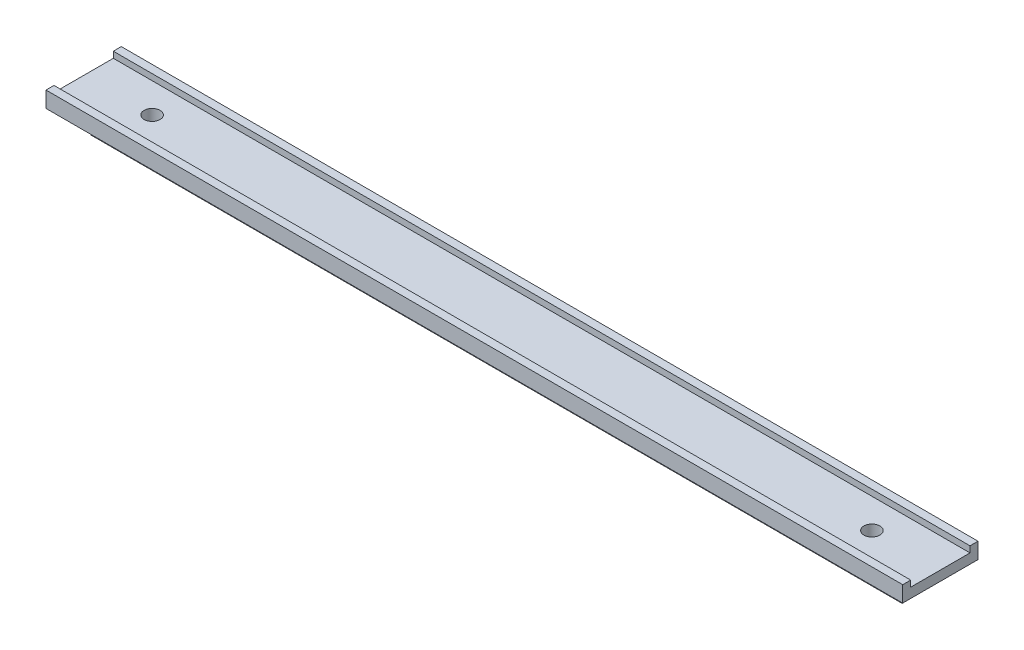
from build123d import *

# Parameters (mm, degrees)
LIUKUKISKOT_HIHNALLE_1_6038_LIUKUKISKO_H_DEPTH = 375.5
CUT_EXTRUDE1_REACH                             = 191.378
F_7_0_7_DIAMETER_HOLE1_D                       = 7
F_7_0_7_DIAMETER_HOLE1_DEPTH                   = 14.3
F_7_0_7_DIAMETER_HOLE1_CSINK_D                 = 7.05
F_7_0_7_DIAMETER_HOLE1_CSINK_ANGLE             = 90
F_7_0_7_DIAMETER_HOLE1_TIP                     = 2.103012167


with BuildPart() as part:
    # Sketch1 → Liukukiskot hihnalle 1.6038 LIUKUKISKO H (new body)
    with BuildSketch(Plane(origin=(-187.75, 0, 0), x_dir=(0, 0, -1), z_dir=(1, 0, 0))):
        Polygon((-16.468721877, 8.565639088), (-16.468721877, 1.565639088), (-3.968721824, 1.565639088), (-3.968721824, -3.234360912), (-6.718721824, -3.234360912), (-6.718721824, -8.434360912), (6.781278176, -8.434360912), (6.781278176, -3.234360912), (4.031278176, -3.234360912), (4.031278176, 1.565639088), (16.531278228, 1.565639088), (16.531278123, 8.565639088), (13.031278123, 8.565639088), (13.031278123, 5.865639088), (-12.968721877, 5.865639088), (-12.968721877, 8.565639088), align=None)
    extrude(amount=LIUKUKISKOT_HIHNALLE_1_6038_LIUKUKISKO_H_DEPTH)

    # Sketch3 → Cut-Extrude1 (cut, up to next)
    with BuildSketch(Plane.XY.offset(6.718721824), mode=Mode.PRIVATE) as cut_extrude1_sk1:
        Polygon((-187.75, -8.434360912), (-187.75, 1.565639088), (-177.75, -8.434360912), align=None)
    cut_extrude1_tool1 = extrude(cut_extrude1_sk1.sketch, amount=-CUT_EXTRUDE1_REACH, mode=Mode.PRIVATE) & part.part
    # Sketch3 → Cut-Extrude1 (cut, up to next)
    with BuildSketch(Plane.XY.offset(6.718721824), mode=Mode.PRIVATE) as cut_extrude1_sk2:
        Polygon((187.75, -8.434360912), (187.75, 1.565639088), (177.75, -8.434360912), align=None)
    cut_extrude1_tool2 = extrude(cut_extrude1_sk2.sketch, amount=-CUT_EXTRUDE1_REACH, mode=Mode.PRIVATE) & part.part
    add(cut_extrude1_tool1.solids().sort_by_distance((-184.416667, -5.101028, 6.718722))[0], mode=Mode.SUBTRACT)
    add(cut_extrude1_tool2.solids().sort_by_distance((184.416667, -5.101028, 6.718722))[0], mode=Mode.SUBTRACT)

    # 7.0 _7_ Diameter Hole1
    with Locations(Plane(origin=(0, -8.434360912, 0), x_dir=(-1, 0, 0), z_dir=(0, -1, 0))):
        with Locations((-157.75, 0.031278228), (157.75, 0.031278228)):
            CounterSinkHole(F_7_0_7_DIAMETER_HOLE1_D / 2, F_7_0_7_DIAMETER_HOLE1_CSINK_D / 2, depth=F_7_0_7_DIAMETER_HOLE1_DEPTH, counter_sink_angle=F_7_0_7_DIAMETER_HOLE1_CSINK_ANGLE)
            with Locations((0, 0, -(F_7_0_7_DIAMETER_HOLE1_DEPTH + F_7_0_7_DIAMETER_HOLE1_TIP / 2))):  # 118° drill point
                Cone(0, F_7_0_7_DIAMETER_HOLE1_D / 2, F_7_0_7_DIAMETER_HOLE1_TIP, mode=Mode.SUBTRACT)


solid = part.part
